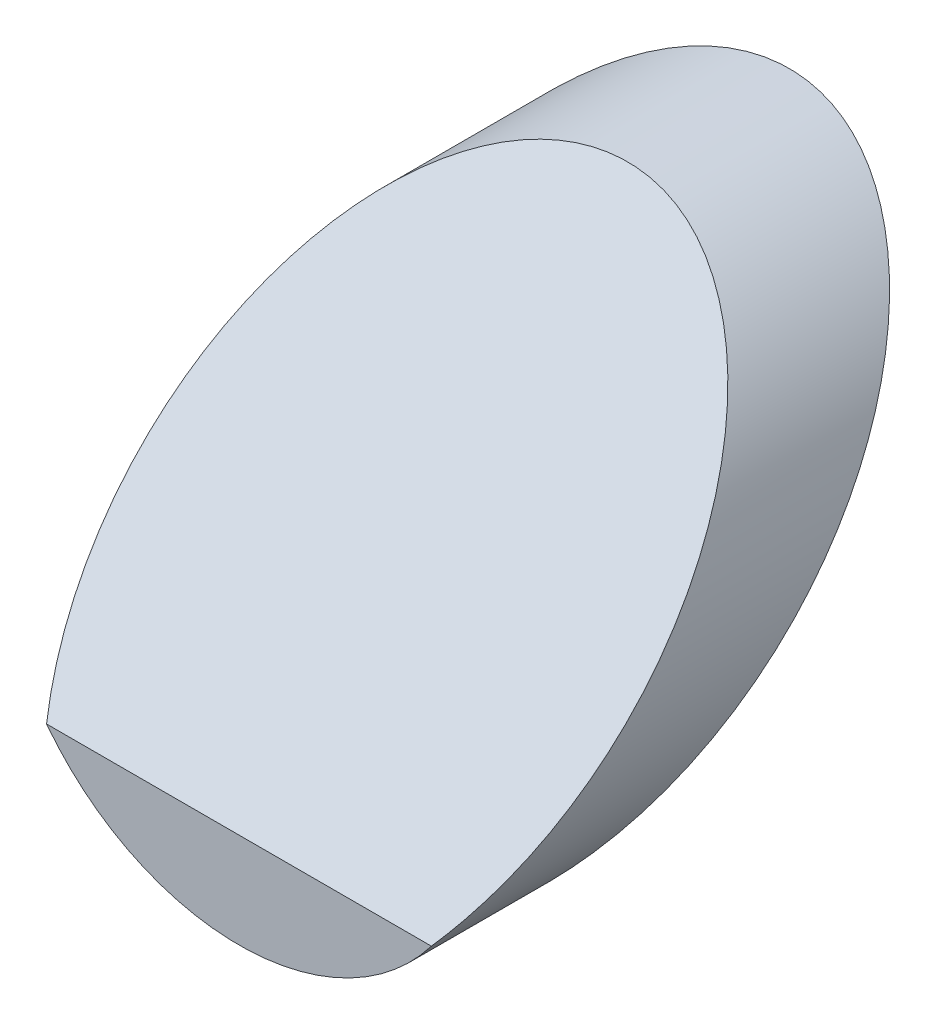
from build123d import *

# Parameters (mm, degrees)
CYLINDER_DEPTH          = 31.75
CYLINDER_DEPTH_BACK     = 50.8
SKETCH1_R               = 25.4
F_45DEG_CUT_DEPTH       = 76.2
F_45DEG_CUT_DEPTH_BACK  = 76.2
SKETCH2_OUTSIDE_W       = 106.436
SKETCH2_OUTSIDE_H       = 74.686
CUT_EXTRUDE1_DEPTH      = 50
CUT_EXTRUDE1_DEPTH_BACK = 50
SKETCH3_W               = 10
SKETCH3_H               = 10.840271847


with BuildPart() as part:
    # Sketch1 → cylinder (new, two sides: drawn at the far end of the back side and taken through both)
    with BuildSketch(Plane.XY.offset(-CYLINDER_DEPTH_BACK)):
        Circle(SKETCH1_R)
    extrude(amount=CYLINDER_DEPTH + CYLINDER_DEPTH_BACK)

    # Sketch2 outside → 45deg_cut (cut, two sides: drawn at the far end of the back side and taken through both)
    with BuildSketch(Plane(origin=(0, 0, 0), x_dir=(0, 0, -1), z_dir=(1, 0, 0)).offset(-F_45DEG_CUT_DEPTH_BACK)):
        with Locations((9.525, 0)):
            Rectangle(SKETCH2_OUTSIDE_W, SKETCH2_OUTSIDE_H)
        Polygon((0, 0), (35.921024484, 35.921024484), (44.406305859, 27.43574311), (-18.552344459, -35.522907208), (-27.43574311, -44.406305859), (-35.921024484, -35.921024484), align=None, mode=Mode.SUBTRACT)
    extrude(amount=F_45DEG_CUT_DEPTH + F_45DEG_CUT_DEPTH_BACK, mode=Mode.SUBTRACT)

    # Sketch3 → Cut-Extrude1 (cut, two sides: drawn at the far end of the back side and taken through both)
    with BuildSketch(Plane(origin=(0, 0, 0), x_dir=(0, 0, -1), z_dir=(1, 0, 0)).offset(-CUT_EXTRUDE1_DEPTH_BACK)):
        with Locations((-20.4, -19.979864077)):
            Rectangle(SKETCH3_W, SKETCH3_H)
    extrude(amount=CUT_EXTRUDE1_DEPTH + CUT_EXTRUDE1_DEPTH_BACK, mode=Mode.SUBTRACT)


solid = part.part
